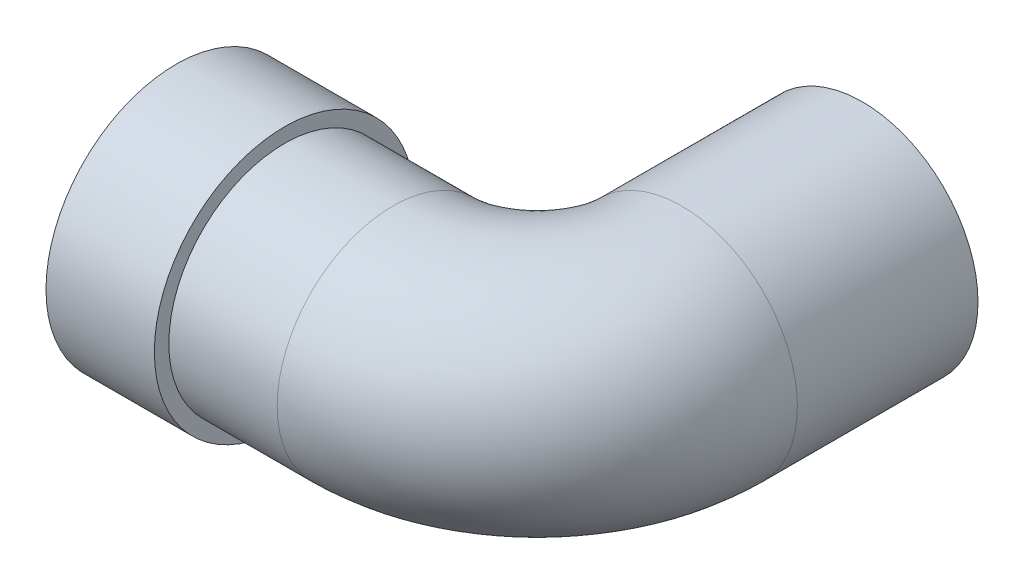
from build123d import *

# Parameters (mm, degrees)
ESQUISSE1_R             = 16
ESQUISSE1_R_2           = 14
BOSS_EXTRU_2_DEPTH      = 10
BOSS_EXTRU_2_DEPTH_BACK = 5
ESQUISSE4_R             = 18
ESQUISSE4_R_2           = 16


with BuildPart() as part:
    # Balayage7: sweep along a path in Esquisse2
    with BuildLine(Plane(origin=(0, 0, 0), x_dir=(1, 0, 0), z_dir=(0, 1, 0))) as balayage7_path:
        Line((0, 0), (0, -25))
        ThreePointArc((0, -25), (-5.857864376, -39.142135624), (-20, -45))
        Line((-20, -45), (-40, -45))
    # Esquisse1 → Balayage7 (sweep)
    with BuildSketch(Plane.XY):
        Circle(ESQUISSE1_R)
        Circle(ESQUISSE1_R_2, mode=Mode.SUBTRACT)
    sweep(path=balayage7_path.line)

    # Esquisse4 → Boss.-Extru.2 (add, two sides: drawn at the far end of the back side and taken through both)
    with BuildSketch(Plane.ZY.offset(40).offset(-BOSS_EXTRU_2_DEPTH_BACK)):
        with Locations((45, 0)):
            Circle(ESQUISSE4_R)
        with Locations((45, 0)):
            Circle(ESQUISSE4_R_2, mode=Mode.SUBTRACT)
    extrude(amount=BOSS_EXTRU_2_DEPTH + BOSS_EXTRU_2_DEPTH_BACK)


solid = part.part
